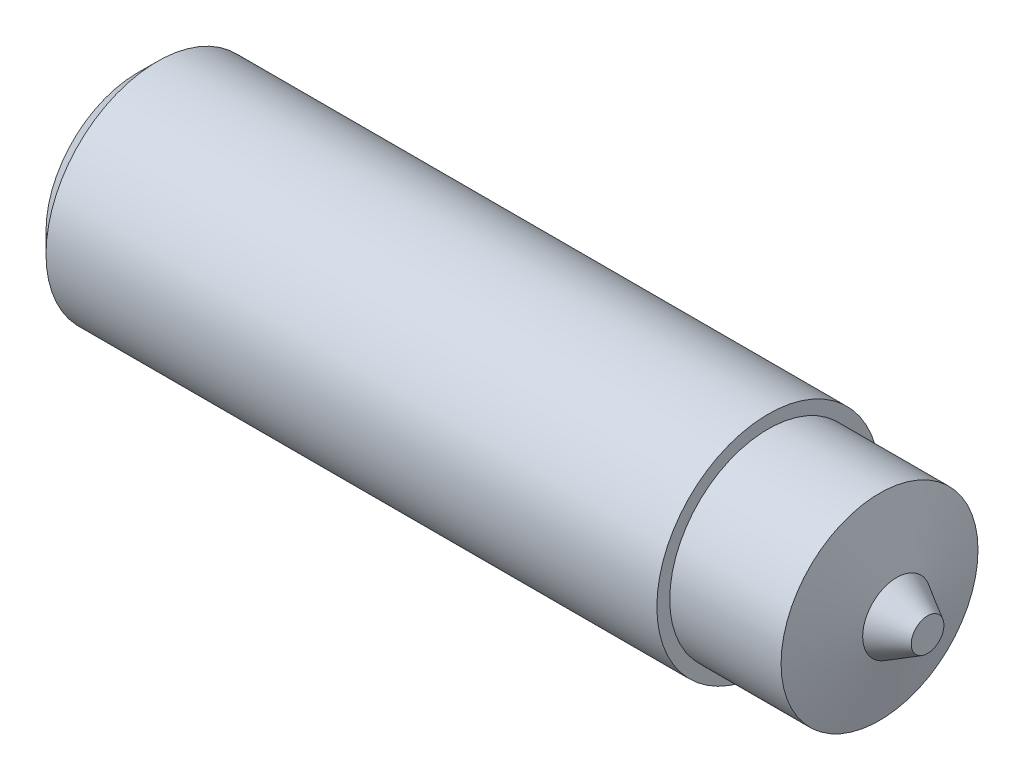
from build123d import *

# Parameters (mm, degrees)
HEADCHAMFER_SIZE = 0.5415


with BuildPart() as part:
    # Sketch1 → Base (revolve)
    with BuildSketch(Plane.XY, mode=Mode.PRIVATE) as base_sk:
        Polygon((0, 0), (0, 3), (17, 3), (17, 2.652751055), (20, 2.652751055), (20.464503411, 0.919200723), (21.294503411, 0.44), (21.294503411, 0), align=None)
    revolve(base_sk.sketch.rotate(Axis((-13.950889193, 0, 0), (1, 0, 0)), 90), axis=Axis((-13.950889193, 0, 0), (1, 0, 0)))

    # HeadChamfer
    headchamfer_edges = [part.edges().sort_by_distance(p)[0] for p in [
        (0, 0, -3),
    ]]
    chamfer(headchamfer_edges, length=HEADCHAMFER_SIZE)


solid = part.part
